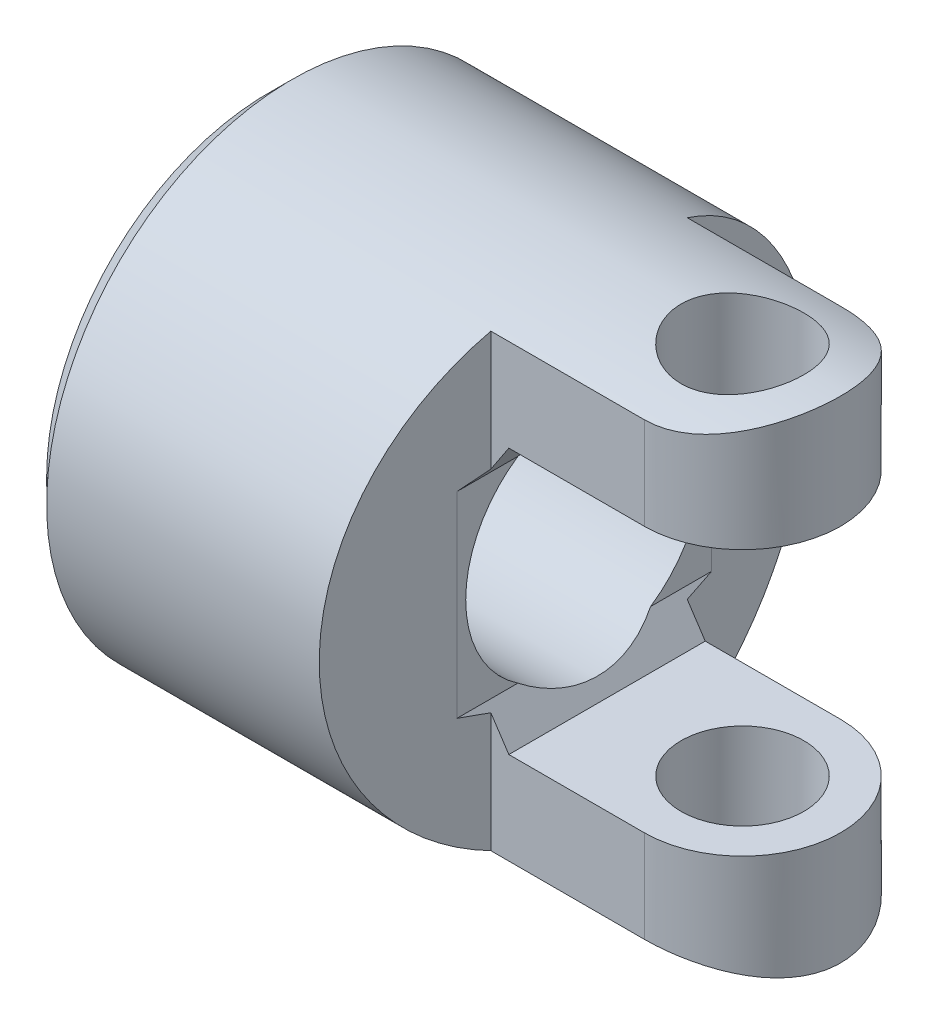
ISO-10303-21;
HEADER;
FILE_DESCRIPTION(('STEP AP214'),'2;1');
FILE_NAME('part.step','',(''),(''),'','','');
FILE_SCHEMA(('AUTOMOTIVE_DESIGN { 1 0 10303 214 1 1 1 1 }'));
ENDSEC;
DATA;
#1=APPLICATION_CONTEXT('core data for automotive mechanical design processes');
#2=APPLICATION_PROTOCOL_DEFINITION('international standard','automotive_design',2000,#1);
#3=PRODUCT_CONTEXT('',#1,'mechanical');
#4=PRODUCT('Part','Part','',(#3));
#5=PRODUCT_RELATED_PRODUCT_CATEGORY('part','',(#4));
#6=PRODUCT_DEFINITION_FORMATION('','',#4);
#7=PRODUCT_DEFINITION_CONTEXT('part definition',#1,'design');
#8=PRODUCT_DEFINITION('design','',#6,#7);
#9=PRODUCT_DEFINITION_SHAPE('','',#8);
#10=(LENGTH_UNIT() NAMED_UNIT(*) SI_UNIT(.MILLI.,.METRE.));
#11=(NAMED_UNIT(*) PLANE_ANGLE_UNIT() SI_UNIT($,.RADIAN.));
#12=(NAMED_UNIT(*) SI_UNIT($,.STERADIAN.) SOLID_ANGLE_UNIT());
#13=UNCERTAINTY_MEASURE_WITH_UNIT(LENGTH_MEASURE(1.E-05),#10,'distance_accuracy_value','');
#14=(GEOMETRIC_REPRESENTATION_CONTEXT(3) GLOBAL_UNCERTAINTY_ASSIGNED_CONTEXT((#13)) GLOBAL_UNIT_ASSIGNED_CONTEXT((#10,
#11,#12)) REPRESENTATION_CONTEXT('',''));
#15=CARTESIAN_POINT('',(0.,0.,0.));
#16=DIRECTION('',(0.,0.,1.));
#17=DIRECTION('',(1.,0.,0.));
#18=AXIS2_PLACEMENT_3D('',#15,#16,#17);
#19=CARTESIAN_POINT('',(0.,0.,0.));
#20=DIRECTION('',(1.,0.,0.));
#21=DIRECTION('',(0.,0.,-1.));
#22=AXIS2_PLACEMENT_3D('',#19,#20,#21);
#23=CONICAL_SURFACE('',#22,13.1,0.785398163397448);
#24=CARTESIAN_POINT('',(1.4,0.,0.));
#25=DIRECTION('',(1.,0.,0.));
#26=DIRECTION('',(0.,0.,-1.));
#27=AXIS2_PLACEMENT_3D('',#24,#25,#26);
#28=CIRCLE('',#27,14.5);
#29=CARTESIAN_POINT('',(1.4,0.,-14.5));
#30=VERTEX_POINT('',#29);
#31=EDGE_CURVE('E586',#30,#30,#28,.F.);
#32=ORIENTED_EDGE('',*,*,#31,.T.);
#33=EDGE_LOOP('',(#32));
#34=FACE_BOUND('',#33,.T.);
#35=CARTESIAN_POINT('',(0.,0.,0.));
#36=DIRECTION('',(1.,0.,0.));
#37=DIRECTION('',(0.,0.,-1.));
#38=AXIS2_PLACEMENT_3D('',#35,#36,#37);
#39=CIRCLE('',#38,13.1);
#40=CARTESIAN_POINT('',(0.,0.,-13.1));
#41=VERTEX_POINT('',#40);
#42=EDGE_CURVE('E583',#41,#41,#39,.F.);
#43=ORIENTED_EDGE('',*,*,#42,.F.);
#44=EDGE_LOOP('',(#43));
#45=FACE_BOUND('',#44,.T.);
#46=ADVANCED_FACE('F381',(#34,#45),#23,.T.);
#47=CARTESIAN_POINT('',(0.,-13.2572,-13.2572));
#48=DIRECTION('',(-1.,0.,0.));
#49=DIRECTION('',(0.,0.,1.));
#50=AXIS2_PLACEMENT_3D('',#47,#48,#49);
#51=PLANE('',#50);
#52=CARTESIAN_POINT('',(0.,0.,0.));
#53=DIRECTION('',(1.,0.,0.));
#54=DIRECTION('',(0.,0.,-1.));
#55=AXIS2_PLACEMENT_3D('',#52,#53,#54);
#56=CIRCLE('',#55,7.);
#57=CARTESIAN_POINT('',(0.,0.,-7.));
#58=VERTEX_POINT('',#57);
#59=EDGE_CURVE('E495',#58,#58,#56,.F.);
#60=ORIENTED_EDGE('',*,*,#59,.F.);
#61=EDGE_LOOP('',(#60));
#62=FACE_BOUND('',#61,.T.);
#63=ORIENTED_EDGE('',*,*,#42,.T.);
#64=EDGE_LOOP('',(#63));
#65=FACE_BOUND('',#64,.T.);
#66=ADVANCED_FACE('F724',(#62,#65),#51,.T.);
#67=CARTESIAN_POINT('',(0.,0.,0.));
#68=DIRECTION('',(1.,0.,0.));
#69=DIRECTION('',(0.,0.,-1.));
#70=AXIS2_PLACEMENT_3D('',#67,#68,#69);
#71=CYLINDRICAL_SURFACE('',#70,7.);
#72=CARTESIAN_POINT('',(14.8181818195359,0.,0.));
#73=DIRECTION('',(0.834176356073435,-0.551497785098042,0.));
#74=DIRECTION('',(0.551497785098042,0.834176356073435,0.));
#75=AXIS2_PLACEMENT_3D('',#72,#73,#74);
#76=ELLIPSE('',#75,8.3915109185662,7.);
#77=CARTESIAN_POINT('',(18.6527272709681,5.79999999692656,3.91918359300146));
#78=VERTEX_POINT('',#77);
#79=CARTESIAN_POINT('',(18.6527272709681,5.79999999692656,-3.91918359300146));
#80=VERTEX_POINT('',#79);
#81=EDGE_CURVE('E503',#78,#80,#76,.F.);
#82=ORIENTED_EDGE('',*,*,#81,.F.);
#83=CARTESIAN_POINT('',(18.6527272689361,0.,0.));
#84=DIRECTION('',(1.,0.,0.));
#85=DIRECTION('',(0.,0.,-1.));
#86=AXIS2_PLACEMENT_3D('',#83,#84,#85);
#87=CIRCLE('',#86,7.);
#88=CARTESIAN_POINT('',(18.6527272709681,-5.79999999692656,3.91918359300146));
#89=VERTEX_POINT('',#88);
#90=EDGE_CURVE('E485',#78,#89,#87,.T.);
#91=ORIENTED_EDGE('',*,*,#90,.T.);
#92=CARTESIAN_POINT('',(14.8181818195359,0.,0.));
#93=DIRECTION('',(-0.834176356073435,-0.551497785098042,0.));
#94=DIRECTION('',(0.551497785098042,-0.834176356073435,0.));
#95=AXIS2_PLACEMENT_3D('',#92,#93,#94);
#96=ELLIPSE('',#95,8.3915109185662,7.);
#97=CARTESIAN_POINT('',(18.6527272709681,-5.79999999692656,-3.91918359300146));
#98=VERTEX_POINT('',#97);
#99=EDGE_CURVE('E494',#89,#98,#96,.F.);
#100=ORIENTED_EDGE('',*,*,#99,.T.);
#101=CARTESIAN_POINT('',(18.6527272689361,0.,0.));
#102=DIRECTION('',(1.,0.,0.));
#103=DIRECTION('',(0.,0.,-1.));
#104=AXIS2_PLACEMENT_3D('',#101,#102,#103);
#105=CIRCLE('',#104,7.);
#106=EDGE_CURVE('E511',#98,#80,#105,.T.);
#107=ORIENTED_EDGE('',*,*,#106,.T.);
#108=EDGE_LOOP('',(#82,#91,#100,#107));
#109=FACE_BOUND('',#108,.T.);
#110=ORIENTED_EDGE('',*,*,#59,.T.);
#111=EDGE_LOOP('',(#110));
#112=FACE_BOUND('',#111,.T.);
#113=ADVANCED_FACE('F508',(#109,#112),#71,.F.);
#114=CARTESIAN_POINT('',(18.652727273,-5.8,3.897557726));
#115=DIRECTION('',(-1.,0.,0.));
#116=DIRECTION('',(0.,0.,1.));
#117=AXIS2_PLACEMENT_3D('',#114,#115,#116);
#118=PLANE('',#117);
#119=ORIENTED_EDGE('',*,*,#90,.F.);
#120=DIRECTION('',(0.,0.,1.));
#121=VECTOR('',#120,1.);
#122=CARTESIAN_POINT('',(18.652727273,5.8,5.7105258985));
#123=LINE('',#122,#121);
#124=CARTESIAN_POINT('',(18.6527272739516,5.79999999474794,7.52349405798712));
#125=VERTEX_POINT('',#124);
#126=EDGE_CURVE('E488',#78,#125,#123,.T.);
#127=ORIENTED_EDGE('',*,*,#126,.T.);
#128=DIRECTION('',(0.,1.,0.));
#129=VECTOR('',#128,1.);
#130=CARTESIAN_POINT('',(18.652727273,0.,7.523494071));
#131=LINE('',#130,#129);
#132=CARTESIAN_POINT('',(18.6527272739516,-5.79999999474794,7.52349405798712));
#133=VERTEX_POINT('',#132);
#134=EDGE_CURVE('E593',#133,#125,#131,.T.);
#135=ORIENTED_EDGE('',*,*,#134,.F.);
#136=DIRECTION('',(0.,0.,1.));
#137=VECTOR('',#136,1.);
#138=CARTESIAN_POINT('',(18.652727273,-5.8,5.7105258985));
#139=LINE('',#138,#137);
#140=EDGE_CURVE('E490',#89,#133,#139,.T.);
#141=ORIENTED_EDGE('',*,*,#140,.F.);
#142=EDGE_LOOP('',(#119,#127,#135,#141));
#143=FACE_BOUND('',#142,.T.);
#144=ADVANCED_FACE('F487',(#143),#118,.F.);
#145=CARTESIAN_POINT('',(18.9375,-13.44894315,5.8));
#146=DIRECTION('',(-0.98662283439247,0.,-0.163019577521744));
#147=DIRECTION('',(-0.163019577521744,0.,0.98662283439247));
#148=AXIS2_PLACEMENT_3D('',#145,#146,#147);
#149=PLANE('',#148);
#150=ORIENTED_EDGE('',*,*,#134,.T.);
#151=DIRECTION('',(0.158278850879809,0.239407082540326,-0.957931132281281));
#152=VECTOR('',#151,1.);
#153=CARTESIAN_POINT('',(18.6527272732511,5.79999999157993,7.5234940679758));
#154=LINE('',#153,#152);
#155=CARTESIAN_POINT('',(18.9374999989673,6.23073731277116,5.80000000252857));
#156=VERTEX_POINT('',#155);
#157=EDGE_CURVE('E505',#125,#156,#154,.T.);
#158=ORIENTED_EDGE('',*,*,#157,.T.);
#159=DIRECTION('',(0.,1.,0.));
#160=VECTOR('',#159,1.);
#161=CARTESIAN_POINT('',(18.9375,0.,5.8));
#162=LINE('',#161,#160);
#163=CARTESIAN_POINT('',(18.9374999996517,13.2894695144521,5.80000000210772));
#164=VERTEX_POINT('',#163);
#165=EDGE_CURVE('E506',#156,#164,#162,.T.);
#166=ORIENTED_EDGE('',*,*,#165,.T.);
#167=CARTESIAN_POINT('',(19.8958333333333,0.,0.));
#168=DIRECTION('',(-0.98662283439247,0.,-0.163019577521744));
#169=DIRECTION('',(0.163019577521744,0.,-0.986622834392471));
#170=AXIS2_PLACEMENT_3D('',#167,#168,#169);
#171=ELLIPSE('',#170,14.6965988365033,14.5);
#172=CARTESIAN_POINT('',(18.9374999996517,-13.2894695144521,5.80000000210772));
#173=VERTEX_POINT('',#172);
#174=EDGE_CURVE('E596',#173,#164,#171,.T.);
#175=ORIENTED_EDGE('',*,*,#174,.F.);
#176=DIRECTION('',(0.,-1.,0.));
#177=VECTOR('',#176,1.);
#178=CARTESIAN_POINT('',(18.9375,0.,5.8));
#179=LINE('',#178,#177);
#180=CARTESIAN_POINT('',(18.9374999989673,-6.23073731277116,5.80000000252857));
#181=VERTEX_POINT('',#180);
#182=EDGE_CURVE('E598',#181,#173,#179,.T.);
#183=ORIENTED_EDGE('',*,*,#182,.F.);
#184=DIRECTION('',(0.158278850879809,-0.239407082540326,-0.957931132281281));
#185=VECTOR('',#184,1.);
#186=CARTESIAN_POINT('',(18.6527272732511,-5.79999999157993,7.5234940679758));
#187=LINE('',#186,#185);
#188=EDGE_CURVE('E601',#133,#181,#187,.T.);
#189=ORIENTED_EDGE('',*,*,#188,.F.);
#190=EDGE_LOOP('',(#150,#158,#166,#175,#183,#189));
#191=FACE_BOUND('',#190,.T.);
#192=ADVANCED_FACE('F650',(#191),#149,.F.);
#193=CARTESIAN_POINT('',(1.4,0.,0.));
#194=DIRECTION('',(1.,0.,0.));
#195=DIRECTION('',(0.,0.,-1.));
#196=AXIS2_PLACEMENT_3D('',#193,#194,#195);
#197=CYLINDRICAL_SURFACE('',#196,14.5);
#198=ORIENTED_EDGE('',*,*,#174,.T.);
#199=DIRECTION('',(-1.,0.,0.));
#200=VECTOR('',#199,1.);
#201=CARTESIAN_POINT('',(17.6972,13.2894695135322,5.80000000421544));
#202=LINE('',#201,#200);
#203=CARTESIAN_POINT('',(28.0000000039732,13.2894695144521,5.80000000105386));
#204=VERTEX_POINT('',#203);
#205=EDGE_CURVE('E529',#164,#204,#202,.F.);
#206=ORIENTED_EDGE('',*,*,#205,.T.);
#207=CARTESIAN_POINT('',(28.0000000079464,13.289469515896,5.80000000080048));
#208=CARTESIAN_POINT('',(28.1560344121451,13.2894366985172,5.80002456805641));
#209=CARTESIAN_POINT('',(28.3120551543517,13.2922164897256,5.7937045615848));
#210=CARTESIAN_POINT('',(28.6228380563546,13.3031595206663,5.76856056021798));
#211=CARTESIAN_POINT('',(28.7776006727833,13.3113207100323,5.74974132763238));
#212=CARTESIAN_POINT('',(29.0841532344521,13.3327429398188,5.69988192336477));
#213=CARTESIAN_POINT('',(29.2359524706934,13.3459838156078,5.66889006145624));
#214=CARTESIAN_POINT('',(29.5361411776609,13.3771242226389,5.59501231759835));
#215=CARTESIAN_POINT('',(29.684530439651,13.3950240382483,5.55212570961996));
#216=CARTESIAN_POINT('',(29.9767318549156,13.4349003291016,5.45492468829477));
#217=CARTESIAN_POINT('',(30.1205498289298,13.4568713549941,5.40062553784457));
#218=CARTESIAN_POINT('',(30.4029741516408,13.5042537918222,5.28102839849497));
#219=CARTESIAN_POINT('',(30.5415785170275,13.529666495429,5.21572627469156));
#220=CARTESIAN_POINT('',(30.9484937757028,13.6100340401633,5.00398023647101));
#221=CARTESIAN_POINT('',(31.2079264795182,13.6691211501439,4.8416900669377));
#222=CARTESIAN_POINT('',(31.7099494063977,13.7953438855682,4.46976732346));
#223=CARTESIAN_POINT('',(31.9509919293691,13.8627369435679,4.25813252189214));
#224=CARTESIAN_POINT('',(32.2840530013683,13.9625170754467,3.91312265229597));
#225=CARTESIAN_POINT('',(32.3903785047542,13.9955784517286,3.79344578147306));
#226=CARTESIAN_POINT('',(32.5929168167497,14.0604297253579,3.54551907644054));
#227=CARTESIAN_POINT('',(32.6891331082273,14.0922200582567,3.41727221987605));
#228=CARTESIAN_POINT('',(32.8744588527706,14.1549440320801,3.14761548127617));
#229=CARTESIAN_POINT('',(32.9631296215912,14.1857924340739,3.0058841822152));
#230=CARTESIAN_POINT('',(33.1281112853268,14.2443525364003,2.71485501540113));
#231=CARTESIAN_POINT('',(33.2044272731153,14.2720655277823,2.56556029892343));
#232=CARTESIAN_POINT('',(33.3440663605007,14.3235760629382,2.26033672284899));
#233=CARTESIAN_POINT('',(33.4073880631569,14.347373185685,2.10440715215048));
#234=CARTESIAN_POINT('',(33.5203710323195,14.390335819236,1.78713253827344));
#235=CARTESIAN_POINT('',(33.5700389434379,14.4095035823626,1.62579017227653));
#236=CARTESIAN_POINT('',(33.6531664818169,14.4418453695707,1.30673869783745));
#237=CARTESIAN_POINT('',(33.6872898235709,14.4552629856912,1.14922708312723));
#238=CARTESIAN_POINT('',(33.7423296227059,14.4770062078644,0.831631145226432));
#239=CARTESIAN_POINT('',(33.7632518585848,14.4853340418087,0.671547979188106));
#240=CARTESIAN_POINT('',(33.7916776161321,14.4966671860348,0.35002181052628));
#241=CARTESIAN_POINT('',(33.7991824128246,14.4996730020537,0.188578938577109));
#242=CARTESIAN_POINT('',(33.8006909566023,14.5002763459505,-0.134377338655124));
#243=CARTESIAN_POINT('',(33.7946951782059,14.4978740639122,-0.29589074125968));
#244=CARTESIAN_POINT('',(33.7699918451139,14.4880187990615,-0.60859613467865));
#245=CARTESIAN_POINT('',(33.752020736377,14.4808584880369,-0.759856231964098));
#246=CARTESIAN_POINT('',(33.7042941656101,14.4619670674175,-1.06026707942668));
#247=CARTESIAN_POINT('',(33.6745347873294,14.4502344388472,-1.20941711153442));
#248=CARTESIAN_POINT('',(33.6035279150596,14.4224983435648,-1.50449181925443));
#249=CARTESIAN_POINT('',(33.5622843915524,14.4064963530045,-1.65041759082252));
#250=CARTESIAN_POINT('',(33.4686593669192,14.3706077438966,-1.93821443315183));
#251=CARTESIAN_POINT('',(33.4162736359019,14.3507196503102,-2.0800839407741));
#252=CARTESIAN_POINT('',(33.2999554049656,14.3072210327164,-2.36091142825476));
#253=CARTESIAN_POINT('',(33.2358648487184,14.2835601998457,-2.49979620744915));
#254=CARTESIAN_POINT('',(33.0971657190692,14.2333035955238,-2.77168169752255));
#255=CARTESIAN_POINT('',(33.0225532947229,14.2067067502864,-2.90468023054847));
#256=CARTESIAN_POINT('',(32.7837335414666,14.1234469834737,-3.2936885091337));
#257=CARTESIAN_POINT('',(32.6044679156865,14.0632854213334,-3.5398928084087));
#258=CARTESIAN_POINT('',(32.1972719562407,13.9351161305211,-4.0158844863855));
#259=CARTESIAN_POINT('',(31.9669211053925,13.8668525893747,-4.24353626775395));
#260=CARTESIAN_POINT('',(31.5952646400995,13.7666866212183,-4.55414569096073));
#261=CARTESIAN_POINT('',(31.4669185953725,13.7336457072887,-4.65259935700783));
#262=CARTESIAN_POINT('',(31.20218755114,13.6692186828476,-4.83860832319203));
#263=CARTESIAN_POINT('',(31.0658055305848,13.6378319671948,-4.926167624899));
#264=CARTESIAN_POINT('',(30.7816623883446,13.5767388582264,-5.09217265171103));
#265=CARTESIAN_POINT('',(30.6336849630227,13.5471086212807,-5.17027627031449));
#266=CARTESIAN_POINT('',(30.3310220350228,13.4915362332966,-5.31360108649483));
#267=CARTESIAN_POINT('',(30.1763394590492,13.4655924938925,-5.3788278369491));
#268=CARTESIAN_POINT('',(29.8614704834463,13.4183043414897,-5.49573380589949));
#269=CARTESIAN_POINT('',(29.7012912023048,13.3969542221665,-5.54742985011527));
#270=CARTESIAN_POINT('',(29.376530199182,13.359596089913,-5.6368008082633));
#271=CARTESIAN_POINT('',(29.2119504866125,13.3435856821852,-5.67448200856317));
#272=CARTESIAN_POINT('',(28.8737042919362,13.3170581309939,-5.73648105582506));
#273=CARTESIAN_POINT('',(28.6999235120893,13.3067583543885,-5.76027174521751));
#274=CARTESIAN_POINT('',(28.3507680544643,13.2929400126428,-5.79204607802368));
#275=CARTESIAN_POINT('',(28.1753944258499,13.289417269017,-5.80003946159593));
#276=CARTESIAN_POINT('',(28.0000000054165,13.2894695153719,-5.8));
#277=B_SPLINE_CURVE_WITH_KNOTS('',3,(#207,#208,#209,#210,#211,#212,#213,#214,#215,#216,#217,
#218,#219,#220,#221,#222,#223,#224,#225,#226,#227,#228,#229,#230,#231,#232,#233,#234,#235,#236,
#237,#238,#239,#240,#241,#242,#243,#244,#245,#246,#247,#248,#249,#250,#251,#252,#253,#254,#255,
#256,#257,#258,#259,#260,#261,#262,#263,#264,#265,#266,#267,#268,#269,#270,#271,#272,#273,#274,
#275,#276),.UNSPECIFIED.,.F.,.F.,(4,2,2,2,2,2,2,2,2,2,2,2,2,2,2,2,2,2,2,2,2,2,2,2,2,2,2,2,2,2,2,
2,2,2,4),(0.,0.467929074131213,0.935679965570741,1.40159294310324,1.86753436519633,
2.33285656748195,2.7983540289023,3.72928693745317,4.70799671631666,5.19794388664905,
5.68772170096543,6.19710599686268,6.70627977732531,7.21550826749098,7.72448850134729,
8.20903093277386,8.69336111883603,9.1776452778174,9.66191241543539,10.1188513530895,
10.5759422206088,11.0328752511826,11.4899820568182,11.9537918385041,12.4177718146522,
13.345140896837,14.3333290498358,14.8281619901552,15.3228126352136,15.8319534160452,
16.3408741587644,16.8491590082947,17.3572155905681,17.8834750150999,18.4094098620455),.UNSPECIFIED.);
#278=CARTESIAN_POINT('',(28.,13.2894695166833,-5.79999999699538));
#279=VERTEX_POINT('',#278);
#280=EDGE_CURVE('E521',#204,#279,#277,.T.);
#281=ORIENTED_EDGE('',*,*,#280,.T.);
#282=DIRECTION('',(1.,0.,0.));
#283=VECTOR('',#282,1.);
#284=CARTESIAN_POINT('',(17.6972,13.2894695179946,-5.79999999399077));
#285=LINE('',#284,#283);
#286=CARTESIAN_POINT('',(18.9375000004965,13.2894695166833,-5.79999999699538));
#287=VERTEX_POINT('',#286);
#288=EDGE_CURVE('E518',#279,#287,#285,.F.);
#289=ORIENTED_EDGE('',*,*,#288,.T.);
#290=CARTESIAN_POINT('',(19.8958333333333,0.,0.));
#291=DIRECTION('',(-0.98662283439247,0.,0.163019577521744));
#292=DIRECTION('',(0.163019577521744,0.,0.986622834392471));
#293=AXIS2_PLACEMENT_3D('',#290,#291,#292);
#294=ELLIPSE('',#293,14.6965988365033,14.5);
#295=CARTESIAN_POINT('',(18.9375000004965,-13.2894695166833,-5.79999999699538));
#296=VERTEX_POINT('',#295);
#297=EDGE_CURVE('E604',#287,#296,#294,.T.);
#298=ORIENTED_EDGE('',*,*,#297,.T.);
#299=DIRECTION('',(1.,0.,0.));
#300=VECTOR('',#299,1.);
#301=CARTESIAN_POINT('',(17.6972,-13.2894695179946,-5.79999999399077));
#302=LINE('',#301,#300);
#303=CARTESIAN_POINT('',(28.,-13.2894695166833,-5.79999999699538));
#304=VERTEX_POINT('',#303);
#305=EDGE_CURVE('E606',#304,#296,#302,.F.);
#306=ORIENTED_EDGE('',*,*,#305,.F.);
#307=CARTESIAN_POINT('',(28.0000000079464,-13.289469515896,5.80000000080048));
#308=CARTESIAN_POINT('',(28.1560344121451,-13.2894366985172,5.80002456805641));
#309=CARTESIAN_POINT('',(28.3120551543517,-13.2922164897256,5.7937045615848));
#310=CARTESIAN_POINT('',(28.6228380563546,-13.3031595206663,5.76856056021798));
#311=CARTESIAN_POINT('',(28.7776006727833,-13.3113207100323,5.74974132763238));
#312=CARTESIAN_POINT('',(29.0841532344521,-13.3327429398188,5.69988192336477));
#313=CARTESIAN_POINT('',(29.2359524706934,-13.3459838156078,5.66889006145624));
#314=CARTESIAN_POINT('',(29.5361411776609,-13.3771242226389,5.59501231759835));
#315=CARTESIAN_POINT('',(29.684530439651,-13.3950240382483,5.55212570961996));
#316=CARTESIAN_POINT('',(29.9767318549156,-13.4349003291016,5.45492468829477));
#317=CARTESIAN_POINT('',(30.1205498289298,-13.4568713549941,5.40062553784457));
#318=CARTESIAN_POINT('',(30.4029741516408,-13.5042537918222,5.28102839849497));
#319=CARTESIAN_POINT('',(30.5415785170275,-13.529666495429,5.21572627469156));
#320=CARTESIAN_POINT('',(30.9484937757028,-13.6100340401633,5.00398023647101));
#321=CARTESIAN_POINT('',(31.2079264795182,-13.6691211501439,4.8416900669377));
#322=CARTESIAN_POINT('',(31.7099494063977,-13.7953438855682,4.46976732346));
#323=CARTESIAN_POINT('',(31.9509919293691,-13.8627369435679,4.25813252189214));
#324=CARTESIAN_POINT('',(32.2840530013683,-13.9625170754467,3.91312265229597));
#325=CARTESIAN_POINT('',(32.3903785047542,-13.9955784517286,3.79344578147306));
#326=CARTESIAN_POINT('',(32.5929168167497,-14.0604297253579,3.54551907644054));
#327=CARTESIAN_POINT('',(32.6891331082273,-14.0922200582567,3.41727221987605));
#328=CARTESIAN_POINT('',(32.8744588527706,-14.1549440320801,3.14761548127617));
#329=CARTESIAN_POINT('',(32.9631296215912,-14.1857924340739,3.0058841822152));
#330=CARTESIAN_POINT('',(33.1281112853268,-14.2443525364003,2.71485501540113));
#331=CARTESIAN_POINT('',(33.2044272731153,-14.2720655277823,2.56556029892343));
#332=CARTESIAN_POINT('',(33.3440663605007,-14.3235760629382,2.26033672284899));
#333=CARTESIAN_POINT('',(33.4073880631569,-14.347373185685,2.10440715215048));
#334=CARTESIAN_POINT('',(33.5203710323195,-14.390335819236,1.78713253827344));
#335=CARTESIAN_POINT('',(33.5700389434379,-14.4095035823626,1.62579017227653));
#336=CARTESIAN_POINT('',(33.6531664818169,-14.4418453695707,1.30673869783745));
#337=CARTESIAN_POINT('',(33.6872898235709,-14.4552629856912,1.14922708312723));
#338=CARTESIAN_POINT('',(33.7423296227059,-14.4770062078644,0.831631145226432));
#339=CARTESIAN_POINT('',(33.7632518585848,-14.4853340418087,0.671547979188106));
#340=CARTESIAN_POINT('',(33.7916776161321,-14.4966671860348,0.35002181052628));
#341=CARTESIAN_POINT('',(33.7991824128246,-14.4996730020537,0.188578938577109));
#342=CARTESIAN_POINT('',(33.8006909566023,-14.5002763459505,-0.134377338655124));
#343=CARTESIAN_POINT('',(33.7946951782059,-14.4978740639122,-0.29589074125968));
#344=CARTESIAN_POINT('',(33.7699918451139,-14.4880187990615,-0.60859613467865));
#345=CARTESIAN_POINT('',(33.752020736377,-14.4808584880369,-0.759856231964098));
#346=CARTESIAN_POINT('',(33.7042941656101,-14.4619670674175,-1.06026707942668));
#347=CARTESIAN_POINT('',(33.6745347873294,-14.4502344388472,-1.20941711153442));
#348=CARTESIAN_POINT('',(33.6035279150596,-14.4224983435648,-1.50449181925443));
#349=CARTESIAN_POINT('',(33.5622843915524,-14.4064963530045,-1.65041759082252));
#350=CARTESIAN_POINT('',(33.4686593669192,-14.3706077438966,-1.93821443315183));
#351=CARTESIAN_POINT('',(33.4162736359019,-14.3507196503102,-2.0800839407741));
#352=CARTESIAN_POINT('',(33.2999554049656,-14.3072210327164,-2.36091142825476));
#353=CARTESIAN_POINT('',(33.2358648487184,-14.2835601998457,-2.49979620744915));
#354=CARTESIAN_POINT('',(33.0971657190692,-14.2333035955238,-2.77168169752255));
#355=CARTESIAN_POINT('',(33.0225532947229,-14.2067067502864,-2.90468023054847));
#356=CARTESIAN_POINT('',(32.7837335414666,-14.1234469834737,-3.2936885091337));
#357=CARTESIAN_POINT('',(32.6044679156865,-14.0632854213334,-3.5398928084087));
#358=CARTESIAN_POINT('',(32.1972719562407,-13.9351161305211,-4.0158844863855));
#359=CARTESIAN_POINT('',(31.9669211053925,-13.8668525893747,-4.24353626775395));
#360=CARTESIAN_POINT('',(31.5952646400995,-13.7666866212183,-4.55414569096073));
#361=CARTESIAN_POINT('',(31.4669185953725,-13.7336457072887,-4.65259935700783));
#362=CARTESIAN_POINT('',(31.20218755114,-13.6692186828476,-4.83860832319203));
#363=CARTESIAN_POINT('',(31.0658055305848,-13.6378319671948,-4.926167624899));
#364=CARTESIAN_POINT('',(30.7816623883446,-13.5767388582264,-5.09217265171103));
#365=CARTESIAN_POINT('',(30.6336849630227,-13.5471086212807,-5.17027627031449));
#366=CARTESIAN_POINT('',(30.3310220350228,-13.4915362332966,-5.31360108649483));
#367=CARTESIAN_POINT('',(30.1763394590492,-13.4655924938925,-5.3788278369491));
#368=CARTESIAN_POINT('',(29.8614704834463,-13.4183043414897,-5.49573380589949));
#369=CARTESIAN_POINT('',(29.7012912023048,-13.3969542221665,-5.54742985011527));
#370=CARTESIAN_POINT('',(29.376530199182,-13.359596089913,-5.6368008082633));
#371=CARTESIAN_POINT('',(29.2119504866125,-13.3435856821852,-5.67448200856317));
#372=CARTESIAN_POINT('',(28.8737042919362,-13.3170581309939,-5.73648105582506));
#373=CARTESIAN_POINT('',(28.6999235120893,-13.3067583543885,-5.76027174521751));
#374=CARTESIAN_POINT('',(28.3507680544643,-13.2929400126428,-5.79204607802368));
#375=CARTESIAN_POINT('',(28.1753944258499,-13.289417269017,-5.80003946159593));
#376=CARTESIAN_POINT('',(28.0000000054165,-13.2894695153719,-5.8));
#377=B_SPLINE_CURVE_WITH_KNOTS('',3,(#307,#308,#309,#310,#311,#312,#313,#314,#315,#316,#317,
#318,#319,#320,#321,#322,#323,#324,#325,#326,#327,#328,#329,#330,#331,#332,#333,#334,#335,#336,
#337,#338,#339,#340,#341,#342,#343,#344,#345,#346,#347,#348,#349,#350,#351,#352,#353,#354,#355,
#356,#357,#358,#359,#360,#361,#362,#363,#364,#365,#366,#367,#368,#369,#370,#371,#372,#373,#374,
#375,#376),.UNSPECIFIED.,.F.,.F.,(4,2,2,2,2,2,2,2,2,2,2,2,2,2,2,2,2,2,2,2,2,2,2,2,2,2,2,2,2,2,2,
2,2,2,4),(0.,0.467929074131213,0.935679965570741,1.40159294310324,1.86753436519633,
2.33285656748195,2.7983540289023,3.72928693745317,4.70799671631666,5.19794388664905,
5.68772170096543,6.19710599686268,6.70627977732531,7.21550826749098,7.72448850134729,
8.20903093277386,8.69336111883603,9.1776452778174,9.66191241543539,10.1188513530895,
10.5759422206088,11.0328752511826,11.4899820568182,11.9537918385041,12.4177718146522,
13.345140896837,14.3333290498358,14.8281619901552,15.3228126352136,15.8319534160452,
16.3408741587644,16.8491590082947,17.3572155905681,17.8834750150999,18.4094098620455),.UNSPECIFIED.);
#378=CARTESIAN_POINT('',(28.0000000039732,-13.2894695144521,5.80000000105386));
#379=VERTEX_POINT('',#378);
#380=EDGE_CURVE('E609',#379,#304,#377,.T.);
#381=ORIENTED_EDGE('',*,*,#380,.F.);
#382=DIRECTION('',(-1.,0.,0.));
#383=VECTOR('',#382,1.);
#384=CARTESIAN_POINT('',(17.6972,-13.2894695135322,5.80000000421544));
#385=LINE('',#384,#383);
#386=EDGE_CURVE('E615',#173,#379,#385,.F.);
#387=ORIENTED_EDGE('',*,*,#386,.F.);
#388=EDGE_LOOP('',(#198,#206,#281,#289,#298,#306,#381,#387));
#389=FACE_BOUND('',#388,.T.);
#390=ORIENTED_EDGE('',*,*,#31,.F.);
#391=EDGE_LOOP('',(#390));
#392=FACE_BOUND('',#391,.T.);
#393=CARTESIAN_POINT('',(28.0000000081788,-14.0395646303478,3.62500000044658));
#394=CARTESIAN_POINT('',(27.8999855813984,-14.0395651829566,3.62499893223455));
#395=CARTESIAN_POINT('',(27.7999585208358,-14.0406374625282,3.62085462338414));
#396=CARTESIAN_POINT('',(27.600620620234,-14.0448891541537,3.60432320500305));
#397=CARTESIAN_POINT('',(27.5013101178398,-14.0480695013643,3.59193243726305));
#398=CARTESIAN_POINT('',(27.2052558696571,-14.0606645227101,3.54245400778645));
#399=CARTESIAN_POINT('',(27.0105437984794,-14.0731329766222,3.49306037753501));
#400=CARTESIAN_POINT('',(26.6328716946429,-14.1047127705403,3.363251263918));
#401=CARTESIAN_POINT('',(26.4498911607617,-14.1238121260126,3.28289171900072));
#402=CARTESIAN_POINT('',(26.1000100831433,-14.1664809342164,3.0935742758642));
#403=CARTESIAN_POINT('',(25.9331055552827,-14.1900492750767,2.98462348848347));
#404=CARTESIAN_POINT('',(25.6164023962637,-14.2395896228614,2.73863052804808));
#405=CARTESIAN_POINT('',(25.4670117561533,-14.2656002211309,2.60107099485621));
#406=CARTESIAN_POINT('',(25.1931534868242,-14.3167603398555,2.30287280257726));
#407=CARTESIAN_POINT('',(25.0686895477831,-14.3419097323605,2.14223073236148));
#408=CARTESIAN_POINT('',(24.8465749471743,-14.3889361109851,1.7996598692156));
#409=CARTESIAN_POINT('',(24.7493219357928,-14.4107626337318,1.61746572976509));
#410=CARTESIAN_POINT('',(24.5869755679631,-14.4482468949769,1.23868010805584));
#411=CARTESIAN_POINT('',(24.5218772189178,-14.4639055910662,1.04209086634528));
#412=CARTESIAN_POINT('',(24.4269856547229,-14.4870189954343,0.644320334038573));
#413=CARTESIAN_POINT('',(24.3965040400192,-14.4946334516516,0.44331270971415));
#414=CARTESIAN_POINT('',(24.3695503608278,-14.5013571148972,0.0389020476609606));
#415=CARTESIAN_POINT('',(24.3730733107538,-14.5004675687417,-0.164500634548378));
#416=CARTESIAN_POINT('',(24.4135334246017,-14.4904023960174,-0.56315123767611));
#417=CARTESIAN_POINT('',(24.4497272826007,-14.4814111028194,-0.758479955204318));
#418=CARTESIAN_POINT('',(24.5533080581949,-14.456367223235,-1.14019999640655));
#419=CARTESIAN_POINT('',(24.6206968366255,-14.440314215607,-1.32659078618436));
#420=CARTESIAN_POINT('',(24.7853558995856,-14.402668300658,-1.6871050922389));
#421=CARTESIAN_POINT('',(24.882891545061,-14.3810264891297,-1.8611020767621));
#422=CARTESIAN_POINT('',(25.1048762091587,-14.3345518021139,-2.19051037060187));
#423=CARTESIAN_POINT('',(25.2293281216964,-14.3097185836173,-2.34591967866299));
#424=CARTESIAN_POINT('',(25.5055414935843,-14.2587795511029,-2.63814809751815));
#425=CARTESIAN_POINT('',(25.6579474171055,-14.2326574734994,-2.77435481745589));
#426=CARTESIAN_POINT('',(25.9838821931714,-14.1826755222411,-3.01950838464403));
#427=CARTESIAN_POINT('',(26.1574203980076,-14.1588166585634,-3.12844309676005));
#428=CARTESIAN_POINT('',(26.4303111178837,-14.1267480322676,-3.26914501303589));
#429=CARTESIAN_POINT('',(26.5237048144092,-14.1166510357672,-3.31236812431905));
#430=CARTESIAN_POINT('',(26.7139514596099,-14.0980267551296,-3.39076227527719));
#431=CARTESIAN_POINT('',(26.810803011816,-14.0894988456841,-3.42593652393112));
#432=CARTESIAN_POINT('',(27.0071114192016,-14.0742899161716,-3.48789038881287));
#433=CARTESIAN_POINT('',(27.1065636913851,-14.0676058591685,-3.51468381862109));
#434=CARTESIAN_POINT('',(27.307460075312,-14.0562775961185,-3.55971929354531));
#435=CARTESIAN_POINT('',(27.4089032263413,-14.0516324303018,-3.57796536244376));
#436=CARTESIAN_POINT('',(27.5919458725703,-14.045259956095,-3.60288756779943));
#437=CARTESIAN_POINT('',(27.6733158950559,-14.0431281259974,-3.61117510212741));
#438=CARTESIAN_POINT('',(27.8364544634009,-14.0402802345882,-3.62223176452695));
#439=CARTESIAN_POINT('',(27.9182230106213,-14.039564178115,-3.62500087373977));
#440=CARTESIAN_POINT('',(28.1000144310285,-14.0395651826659,-3.62499893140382));
#441=CARTESIAN_POINT('',(28.2000414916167,-14.0406374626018,-3.62085462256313));
#442=CARTESIAN_POINT('',(28.3993793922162,-14.0448891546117,-3.60432320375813));
#443=CARTESIAN_POINT('',(28.4986898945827,-14.0480695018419,-3.59193243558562));
#444=CARTESIAN_POINT('',(28.7947441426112,-14.0606645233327,-3.54245400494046));
#445=CARTESIAN_POINT('',(28.9894562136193,-14.0731329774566,-3.49306037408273));
#446=CARTESIAN_POINT('',(29.3671283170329,-14.1047127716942,-3.3632512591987));
#447=CARTESIAN_POINT('',(29.5501088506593,-14.1238121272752,-3.28289171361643));
#448=CARTESIAN_POINT('',(29.8999899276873,-14.1664809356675,-3.09357426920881));
#449=CARTESIAN_POINT('',(30.0668944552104,-14.190049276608,-2.9846234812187));
#450=CARTESIAN_POINT('',(30.3835976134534,-14.2395896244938,-2.73863051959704));
#451=CARTESIAN_POINT('',(30.5329882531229,-14.265600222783,-2.60107098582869));
#452=CARTESIAN_POINT('',(30.8068465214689,-14.3167603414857,-2.30287279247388));
#453=CARTESIAN_POINT('',(30.931310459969,-14.3419097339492,-2.14223072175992));
#454=CARTESIAN_POINT('',(31.1534250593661,-14.3889361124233,-1.79965985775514));
#455=CARTESIAN_POINT('',(31.2506780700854,-14.4107626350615,-1.61746571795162));
#456=CARTESIAN_POINT('',(31.4130244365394,-14.4482468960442,-1.23868009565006));
#457=CARTESIAN_POINT('',(31.4781227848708,-14.4639055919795,-1.04209085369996));
#458=CARTESIAN_POINT('',(31.573014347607,-14.4870189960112,-0.644320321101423));
#459=CARTESIAN_POINT('',(31.6034959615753,-14.4946334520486,-0.443312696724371));
#460=CARTESIAN_POINT('',(31.6304496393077,-14.5013571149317,-0.0389020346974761));
#461=CARTESIAN_POINT('',(31.626926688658,-14.5004675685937,0.164500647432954));
#462=CARTESIAN_POINT('',(31.5864665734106,-14.4904023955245,0.563151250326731));
#463=CARTESIAN_POINT('',(31.5502727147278,-14.4814111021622,0.758479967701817));
#464=CARTESIAN_POINT('',(31.4466919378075,-14.4563672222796,1.14020000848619));
#465=CARTESIAN_POINT('',(31.3793031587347,-14.4403142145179,1.3265907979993));
#466=CARTESIAN_POINT('',(31.2146440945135,-14.4026682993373,1.68710510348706));
#467=CARTESIAN_POINT('',(31.1171084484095,-14.3810264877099,1.8611020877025));
#468=CARTESIAN_POINT('',(30.8951237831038,-14.3345518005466,2.19051038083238));
#469=CARTESIAN_POINT('',(30.7706718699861,-14.3097185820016,2.34591968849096));
#470=CARTESIAN_POINT('',(30.4944584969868,-14.2587795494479,2.63814810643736));
#471=CARTESIAN_POINT('',(30.3420525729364,-14.2326574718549,2.7743548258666));
#472=CARTESIAN_POINT('',(30.0161177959,-14.1826755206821,3.01950839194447));
#473=CARTESIAN_POINT('',(29.8425795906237,-14.1588166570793,3.12844310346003));
#474=CARTESIAN_POINT('',(29.5696888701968,-14.1267480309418,3.26914501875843));
#475=CARTESIAN_POINT('',(29.4762951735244,-14.1166510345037,3.31236812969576));
#476=CARTESIAN_POINT('',(29.2860485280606,-14.0980267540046,3.39076227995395));
#477=CARTESIAN_POINT('',(29.1891969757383,-14.0894988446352,3.42593652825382));
#478=CARTESIAN_POINT('',(28.9928885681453,-14.0742899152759,3.48789039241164));
#479=CARTESIAN_POINT('',(28.8934362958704,-14.0676058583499,3.51468382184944));
#480=CARTESIAN_POINT('',(28.6925399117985,-14.0562775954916,3.55971929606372));
#481=CARTESIAN_POINT('',(28.5910967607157,-14.0516324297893,3.57796536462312));
#482=CARTESIAN_POINT('',(28.4080541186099,-14.0452599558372,3.60288756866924));
#483=CARTESIAN_POINT('',(28.3266841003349,-14.0431281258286,3.61117510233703));
#484=CARTESIAN_POINT('',(28.1635455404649,-14.040280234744,3.62223176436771));
#485=CARTESIAN_POINT('',(28.081776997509,-14.0395641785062,3.6250008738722));
#486=CARTESIAN_POINT('',(28.0000000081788,-14.0395646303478,3.62500000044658));
#487=B_SPLINE_CURVE_WITH_KNOTS('',3,(#393,#394,#395,#396,#397,#398,#399,#400,#401,#402,#403,
#404,#405,#406,#407,#408,#409,#410,#411,#412,#413,#414,#415,#416,#417,#418,#419,#420,#421,#422,
#423,#424,#425,#426,#427,#428,#429,#430,#431,#432,#433,#434,#435,#436,#437,#438,#439,#440,#441,
#442,#443,#444,#445,#446,#447,#448,#449,#450,#451,#452,#453,#454,#455,#456,#457,#458,#459,#460,
#461,#462,#463,#464,#465,#466,#467,#468,#469,#470,#471,#472,#473,#474,#475,#476,#477,#478,#479,
#480,#481,#482,#483,#484,#485,#486),.UNSPECIFIED.,.T.,.F.,(4,2,2,2,2,2,2,2,2,2,2,2,2,2,2,2,2,2,
2,2,2,2,2,2,2,2,2,2,2,2,2,2,2,2,2,2,2,2,2,2,2,2,2,2,2,2,4),(0.,0.299962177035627,
0.600057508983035,1.20070544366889,1.80027338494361,2.39969235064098,3.01107729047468,
3.62255267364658,4.24254569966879,4.86244243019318,5.46978312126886,6.07703476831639,
6.6708095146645,7.2646196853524,7.86381321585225,8.46307120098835,9.07844608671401,
9.69409430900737,10.0039934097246,10.313768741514,10.6230307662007,10.9321470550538,
11.1774108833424,11.4226755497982,11.7226377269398,12.0227330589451,12.6233809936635,
13.2229489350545,13.8223679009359,14.4337528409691,15.045228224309,15.6652212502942,
16.285117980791,16.8924586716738,17.4997103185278,18.0934850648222,18.6872952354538,
19.2864887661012,19.885746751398,20.5011216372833,21.1167698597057,21.4266689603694,
21.7364442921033,22.0457063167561,22.3548226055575,22.6000864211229,22.8453510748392),.UNSPECIFIED.);
#488=CARTESIAN_POINT('',(28.0000000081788,-14.0395646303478,3.62500000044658));
#489=VERTEX_POINT('',#488);
#490=EDGE_CURVE('E672',#489,#489,#487,.T.);
#491=ORIENTED_EDGE('',*,*,#490,.F.);
#492=EDGE_LOOP('',(#491));
#493=FACE_BOUND('',#492,.T.);
#494=CARTESIAN_POINT('',(28.0000000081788,14.0395646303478,3.62500000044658));
#495=CARTESIAN_POINT('',(27.8999855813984,14.0395651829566,3.62499893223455));
#496=CARTESIAN_POINT('',(27.7999585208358,14.0406374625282,3.62085462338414));
#497=CARTESIAN_POINT('',(27.600620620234,14.0448891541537,3.60432320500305));
#498=CARTESIAN_POINT('',(27.5013101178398,14.0480695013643,3.59193243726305));
#499=CARTESIAN_POINT('',(27.2052558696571,14.0606645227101,3.54245400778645));
#500=CARTESIAN_POINT('',(27.0105437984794,14.0731329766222,3.49306037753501));
#501=CARTESIAN_POINT('',(26.6328716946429,14.1047127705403,3.363251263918));
#502=CARTESIAN_POINT('',(26.4498911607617,14.1238121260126,3.28289171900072));
#503=CARTESIAN_POINT('',(26.1000100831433,14.1664809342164,3.0935742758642));
#504=CARTESIAN_POINT('',(25.9331055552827,14.1900492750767,2.98462348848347));
#505=CARTESIAN_POINT('',(25.6164023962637,14.2395896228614,2.73863052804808));
#506=CARTESIAN_POINT('',(25.4670117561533,14.2656002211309,2.60107099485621));
#507=CARTESIAN_POINT('',(25.1931534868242,14.3167603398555,2.30287280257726));
#508=CARTESIAN_POINT('',(25.0686895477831,14.3419097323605,2.14223073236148));
#509=CARTESIAN_POINT('',(24.8465749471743,14.3889361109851,1.7996598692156));
#510=CARTESIAN_POINT('',(24.7493219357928,14.4107626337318,1.61746572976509));
#511=CARTESIAN_POINT('',(24.5869755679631,14.4482468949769,1.23868010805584));
#512=CARTESIAN_POINT('',(24.5218772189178,14.4639055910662,1.04209086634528));
#513=CARTESIAN_POINT('',(24.4269856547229,14.4870189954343,0.644320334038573));
#514=CARTESIAN_POINT('',(24.3965040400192,14.4946334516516,0.44331270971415));
#515=CARTESIAN_POINT('',(24.3695503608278,14.5013571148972,0.0389020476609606));
#516=CARTESIAN_POINT('',(24.3730733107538,14.5004675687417,-0.164500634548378));
#517=CARTESIAN_POINT('',(24.4135334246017,14.4904023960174,-0.56315123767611));
#518=CARTESIAN_POINT('',(24.4497272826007,14.4814111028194,-0.758479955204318));
#519=CARTESIAN_POINT('',(24.5533080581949,14.456367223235,-1.14019999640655));
#520=CARTESIAN_POINT('',(24.6206968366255,14.440314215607,-1.32659078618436));
#521=CARTESIAN_POINT('',(24.7853558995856,14.402668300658,-1.6871050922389));
#522=CARTESIAN_POINT('',(24.882891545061,14.3810264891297,-1.8611020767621));
#523=CARTESIAN_POINT('',(25.1048762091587,14.3345518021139,-2.19051037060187));
#524=CARTESIAN_POINT('',(25.2293281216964,14.3097185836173,-2.34591967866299));
#525=CARTESIAN_POINT('',(25.5055414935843,14.2587795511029,-2.63814809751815));
#526=CARTESIAN_POINT('',(25.6579474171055,14.2326574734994,-2.77435481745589));
#527=CARTESIAN_POINT('',(25.9838821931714,14.1826755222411,-3.01950838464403));
#528=CARTESIAN_POINT('',(26.1574203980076,14.1588166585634,-3.12844309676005));
#529=CARTESIAN_POINT('',(26.4303111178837,14.1267480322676,-3.26914501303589));
#530=CARTESIAN_POINT('',(26.5237048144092,14.1166510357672,-3.31236812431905));
#531=CARTESIAN_POINT('',(26.7139514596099,14.0980267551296,-3.39076227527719));
#532=CARTESIAN_POINT('',(26.810803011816,14.0894988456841,-3.42593652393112));
#533=CARTESIAN_POINT('',(27.0071114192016,14.0742899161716,-3.48789038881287));
#534=CARTESIAN_POINT('',(27.1065636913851,14.0676058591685,-3.51468381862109));
#535=CARTESIAN_POINT('',(27.307460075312,14.0562775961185,-3.55971929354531));
#536=CARTESIAN_POINT('',(27.4089032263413,14.0516324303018,-3.57796536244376));
#537=CARTESIAN_POINT('',(27.5919458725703,14.045259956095,-3.60288756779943));
#538=CARTESIAN_POINT('',(27.6733158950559,14.0431281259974,-3.61117510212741));
#539=CARTESIAN_POINT('',(27.8364544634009,14.0402802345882,-3.62223176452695));
#540=CARTESIAN_POINT('',(27.9182230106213,14.039564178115,-3.62500087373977));
#541=CARTESIAN_POINT('',(28.1000144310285,14.0395651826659,-3.62499893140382));
#542=CARTESIAN_POINT('',(28.2000414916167,14.0406374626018,-3.62085462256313));
#543=CARTESIAN_POINT('',(28.3993793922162,14.0448891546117,-3.60432320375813));
#544=CARTESIAN_POINT('',(28.4986898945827,14.0480695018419,-3.59193243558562));
#545=CARTESIAN_POINT('',(28.7947441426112,14.0606645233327,-3.54245400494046));
#546=CARTESIAN_POINT('',(28.9894562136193,14.0731329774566,-3.49306037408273));
#547=CARTESIAN_POINT('',(29.3671283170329,14.1047127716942,-3.3632512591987));
#548=CARTESIAN_POINT('',(29.5501088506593,14.1238121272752,-3.28289171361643));
#549=CARTESIAN_POINT('',(29.8999899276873,14.1664809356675,-3.09357426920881));
#550=CARTESIAN_POINT('',(30.0668944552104,14.190049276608,-2.9846234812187));
#551=CARTESIAN_POINT('',(30.3835976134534,14.2395896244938,-2.73863051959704));
#552=CARTESIAN_POINT('',(30.5329882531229,14.265600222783,-2.60107098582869));
#553=CARTESIAN_POINT('',(30.8068465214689,14.3167603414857,-2.30287279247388));
#554=CARTESIAN_POINT('',(30.931310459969,14.3419097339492,-2.14223072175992));
#555=CARTESIAN_POINT('',(31.1534250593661,14.3889361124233,-1.79965985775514));
#556=CARTESIAN_POINT('',(31.2506780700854,14.4107626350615,-1.61746571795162));
#557=CARTESIAN_POINT('',(31.4130244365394,14.4482468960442,-1.23868009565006));
#558=CARTESIAN_POINT('',(31.4781227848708,14.4639055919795,-1.04209085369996));
#559=CARTESIAN_POINT('',(31.573014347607,14.4870189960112,-0.644320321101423));
#560=CARTESIAN_POINT('',(31.6034959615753,14.4946334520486,-0.443312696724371));
#561=CARTESIAN_POINT('',(31.6304496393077,14.5013571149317,-0.0389020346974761));
#562=CARTESIAN_POINT('',(31.626926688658,14.5004675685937,0.164500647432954));
#563=CARTESIAN_POINT('',(31.5864665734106,14.4904023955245,0.563151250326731));
#564=CARTESIAN_POINT('',(31.5502727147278,14.4814111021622,0.758479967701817));
#565=CARTESIAN_POINT('',(31.4466919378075,14.4563672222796,1.14020000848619));
#566=CARTESIAN_POINT('',(31.3793031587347,14.4403142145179,1.3265907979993));
#567=CARTESIAN_POINT('',(31.2146440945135,14.4026682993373,1.68710510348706));
#568=CARTESIAN_POINT('',(31.1171084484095,14.3810264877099,1.8611020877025));
#569=CARTESIAN_POINT('',(30.8951237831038,14.3345518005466,2.19051038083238));
#570=CARTESIAN_POINT('',(30.7706718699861,14.3097185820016,2.34591968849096));
#571=CARTESIAN_POINT('',(30.4944584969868,14.2587795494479,2.63814810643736));
#572=CARTESIAN_POINT('',(30.3420525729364,14.2326574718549,2.7743548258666));
#573=CARTESIAN_POINT('',(30.0161177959,14.1826755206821,3.01950839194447));
#574=CARTESIAN_POINT('',(29.8425795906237,14.1588166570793,3.12844310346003));
#575=CARTESIAN_POINT('',(29.5696888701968,14.1267480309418,3.26914501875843));
#576=CARTESIAN_POINT('',(29.4762951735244,14.1166510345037,3.31236812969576));
#577=CARTESIAN_POINT('',(29.2860485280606,14.0980267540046,3.39076227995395));
#578=CARTESIAN_POINT('',(29.1891969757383,14.0894988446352,3.42593652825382));
#579=CARTESIAN_POINT('',(28.9928885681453,14.0742899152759,3.48789039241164));
#580=CARTESIAN_POINT('',(28.8934362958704,14.0676058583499,3.51468382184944));
#581=CARTESIAN_POINT('',(28.6925399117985,14.0562775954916,3.55971929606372));
#582=CARTESIAN_POINT('',(28.5910967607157,14.0516324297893,3.57796536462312));
#583=CARTESIAN_POINT('',(28.4080541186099,14.0452599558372,3.60288756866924));
#584=CARTESIAN_POINT('',(28.3266841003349,14.0431281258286,3.61117510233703));
#585=CARTESIAN_POINT('',(28.1635455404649,14.040280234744,3.62223176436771));
#586=CARTESIAN_POINT('',(28.081776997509,14.0395641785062,3.6250008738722));
#587=CARTESIAN_POINT('',(28.0000000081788,14.0395646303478,3.62500000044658));
#588=B_SPLINE_CURVE_WITH_KNOTS('',3,(#494,#495,#496,#497,#498,#499,#500,#501,#502,#503,#504,
#505,#506,#507,#508,#509,#510,#511,#512,#513,#514,#515,#516,#517,#518,#519,#520,#521,#522,#523,
#524,#525,#526,#527,#528,#529,#530,#531,#532,#533,#534,#535,#536,#537,#538,#539,#540,#541,#542,
#543,#544,#545,#546,#547,#548,#549,#550,#551,#552,#553,#554,#555,#556,#557,#558,#559,#560,#561,
#562,#563,#564,#565,#566,#567,#568,#569,#570,#571,#572,#573,#574,#575,#576,#577,#578,#579,#580,
#581,#582,#583,#584,#585,#586,#587),.UNSPECIFIED.,.T.,.F.,(4,2,2,2,2,2,2,2,2,2,2,2,2,2,2,2,2,2,
2,2,2,2,2,2,2,2,2,2,2,2,2,2,2,2,2,2,2,2,2,2,2,2,2,2,2,2,4),(0.,0.299962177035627,
0.600057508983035,1.20070544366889,1.80027338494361,2.39969235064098,3.01107729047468,
3.62255267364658,4.24254569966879,4.86244243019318,5.46978312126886,6.07703476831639,
6.6708095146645,7.2646196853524,7.86381321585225,8.46307120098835,9.07844608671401,
9.69409430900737,10.0039934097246,10.313768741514,10.6230307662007,10.9321470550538,
11.1774108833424,11.4226755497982,11.7226377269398,12.0227330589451,12.6233809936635,
13.2229489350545,13.8223679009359,14.4337528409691,15.045228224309,15.6652212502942,
16.285117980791,16.8924586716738,17.4997103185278,18.0934850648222,18.6872952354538,
19.2864887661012,19.885746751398,20.5011216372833,21.1167698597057,21.4266689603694,
21.7364442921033,22.0457063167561,22.3548226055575,22.6000864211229,22.8453510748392),.UNSPECIFIED.);
#589=CARTESIAN_POINT('',(28.0000000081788,14.0395646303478,3.62500000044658));
#590=VERTEX_POINT('',#589);
#591=EDGE_CURVE('E546',#590,#590,#588,.T.);
#592=ORIENTED_EDGE('',*,*,#591,.T.);
#593=EDGE_LOOP('',(#592));
#594=FACE_BOUND('',#593,.T.);
#595=ADVANCED_FACE('F531',(#389,#392,#493,#594),#197,.T.);
#596=CARTESIAN_POINT('',(17.491375,-13.44894315,-14.5522));
#597=DIRECTION('',(-0.98662283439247,0.,0.163019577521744));
#598=DIRECTION('',(0.163019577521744,0.,0.98662283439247));
#599=AXIS2_PLACEMENT_3D('',#596,#597,#598);
#600=PLANE('',#599);
#601=ORIENTED_EDGE('',*,*,#297,.F.);
#602=DIRECTION('',(0.,-1.,0.));
#603=VECTOR('',#602,1.);
#604=CARTESIAN_POINT('',(18.9375,0.,-5.8));
#605=LINE('',#604,#603);
#606=CARTESIAN_POINT('',(18.9375000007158,6.23073731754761,-5.8000000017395));
#607=VERTEX_POINT('',#606);
#608=EDGE_CURVE('E554',#287,#607,#605,.T.);
#609=ORIENTED_EDGE('',*,*,#608,.T.);
#610=DIRECTION('',(0.158278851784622,0.239407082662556,0.957931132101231));
#611=VECTOR('',#610,1.);
#612=CARTESIAN_POINT('',(18.652727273,5.8,-7.52349406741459));
#613=LINE('',#612,#611);
#614=CARTESIAN_POINT('',(18.6527272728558,5.79999999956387,-7.52349406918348));
#615=VERTEX_POINT('',#614);
#616=EDGE_CURVE('E551',#615,#607,#613,.T.);
#617=ORIENTED_EDGE('',*,*,#616,.F.);
#618=DIRECTION('',(0.,-1.,0.));
#619=VECTOR('',#618,1.);
#620=CARTESIAN_POINT('',(18.652727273,0.,-7.523494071));
#621=LINE('',#620,#619);
#622=CARTESIAN_POINT('',(18.6527272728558,-5.79999999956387,-7.52349406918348));
#623=VERTEX_POINT('',#622);
#624=EDGE_CURVE('E668',#615,#623,#621,.T.);
#625=ORIENTED_EDGE('',*,*,#624,.T.);
#626=DIRECTION('',(0.158278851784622,-0.239407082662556,0.957931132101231));
#627=VECTOR('',#626,1.);
#628=CARTESIAN_POINT('',(18.652727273,-5.8,-7.52349406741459));
#629=LINE('',#628,#627);
#630=CARTESIAN_POINT('',(18.9375000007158,-6.23073731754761,-5.8000000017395));
#631=VERTEX_POINT('',#630);
#632=EDGE_CURVE('E670',#623,#631,#629,.T.);
#633=ORIENTED_EDGE('',*,*,#632,.T.);
#634=DIRECTION('',(0.,1.,0.));
#635=VECTOR('',#634,1.);
#636=CARTESIAN_POINT('',(18.9375,0.,-5.8));
#637=LINE('',#636,#635);
#638=EDGE_CURVE('E656',#296,#631,#637,.T.);
#639=ORIENTED_EDGE('',*,*,#638,.F.);
#640=EDGE_LOOP('',(#601,#609,#617,#625,#633,#639));
#641=FACE_BOUND('',#640,.T.);
#642=ADVANCED_FACE('F643',(#641),#600,.F.);
#643=CARTESIAN_POINT('',(18.652727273,-5.8,-7.523494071));
#644=DIRECTION('',(-1.,0.,0.));
#645=DIRECTION('',(0.,0.,1.));
#646=AXIS2_PLACEMENT_3D('',#643,#644,#645);
#647=PLANE('',#646);
#648=ORIENTED_EDGE('',*,*,#624,.F.);
#649=DIRECTION('',(0.,0.,-1.));
#650=VECTOR('',#649,1.);
#651=CARTESIAN_POINT('',(18.652727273,5.8,0.));
#652=LINE('',#651,#650);
#653=EDGE_CURVE('E557',#80,#615,#652,.T.);
#654=ORIENTED_EDGE('',*,*,#653,.F.);
#655=ORIENTED_EDGE('',*,*,#106,.F.);
#656=DIRECTION('',(0.,0.,-1.));
#657=VECTOR('',#656,1.);
#658=CARTESIAN_POINT('',(18.652727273,-5.8,0.));
#659=LINE('',#658,#657);
#660=EDGE_CURVE('E676',#98,#623,#659,.T.);
#661=ORIENTED_EDGE('',*,*,#660,.T.);
#662=EDGE_LOOP('',(#648,#654,#655,#661));
#663=FACE_BOUND('',#662,.T.);
#664=ADVANCED_FACE('F640',(#663),#647,.F.);
#665=CARTESIAN_POINT('',(18.652727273,-5.8,-7.613776));
#666=DIRECTION('',(-0.834176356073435,-0.551497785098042,0.));
#667=DIRECTION('',(0.551497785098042,-0.834176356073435,0.));
#668=AXIS2_PLACEMENT_3D('',#665,#666,#667);
#669=PLANE('',#668);
#670=DIRECTION('',(0.55149778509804,-0.834176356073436,0.));
#671=VECTOR('',#670,1.);
#672=CARTESIAN_POINT('',(19.3263636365,-6.818918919,-5.80000000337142));
#673=LINE('',#672,#671);
#674=CARTESIAN_POINT('',(20.0000000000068,-7.83783783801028,-5.80000000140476));
#675=VERTEX_POINT('',#674);
#676=EDGE_CURVE('E678',#631,#675,#673,.T.);
#677=ORIENTED_EDGE('',*,*,#676,.F.);
#678=ORIENTED_EDGE('',*,*,#632,.F.);
#679=ORIENTED_EDGE('',*,*,#660,.F.);
#680=ORIENTED_EDGE('',*,*,#99,.F.);
#681=ORIENTED_EDGE('',*,*,#140,.T.);
#682=ORIENTED_EDGE('',*,*,#188,.T.);
#683=DIRECTION('',(-0.551497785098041,0.834176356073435,0.));
#684=VECTOR('',#683,1.);
#685=CARTESIAN_POINT('',(19.3263636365,-6.818918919,5.80000000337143));
#686=LINE('',#685,#684);
#687=CARTESIAN_POINT('',(20.,-7.83783783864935,5.80000000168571));
#688=VERTEX_POINT('',#687);
#689=EDGE_CURVE('E681',#688,#181,#686,.T.);
#690=ORIENTED_EDGE('',*,*,#689,.F.);
#691=DIRECTION('',(0.,0.,1.));
#692=VECTOR('',#691,1.);
#693=CARTESIAN_POINT('',(20.,-7.837837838,0.));
#694=LINE('',#693,#692);
#695=EDGE_CURVE('E687',#675,#688,#694,.T.);
#696=ORIENTED_EDGE('',*,*,#695,.F.);
#697=EDGE_LOOP('',(#677,#678,#679,#680,#681,#682,#690,#696));
#698=FACE_BOUND('',#697,.T.);
#699=ADVANCED_FACE('F637',(#698),#669,.F.);
#700=CARTESIAN_POINT('',(18.9375,-13.289469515,-5.8));
#701=DIRECTION('',(0.,0.,1.));
#702=DIRECTION('',(1.,0.,0.));
#703=AXIS2_PLACEMENT_3D('',#700,#701,#702);
#704=PLANE('',#703);
#705=ORIENTED_EDGE('',*,*,#305,.T.);
#706=ORIENTED_EDGE('',*,*,#638,.T.);
#707=ORIENTED_EDGE('',*,*,#676,.T.);
#708=DIRECTION('',(1.,0.,0.));
#709=VECTOR('',#708,1.);
#710=CARTESIAN_POINT('',(26.9414,-7.837837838,-5.8));
#711=LINE('',#710,#709);
#712=CARTESIAN_POINT('',(28.,-7.837837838,-5.8));
#713=VERTEX_POINT('',#712);
#714=EDGE_CURVE('E404',#675,#713,#711,.T.);
#715=ORIENTED_EDGE('',*,*,#714,.T.);
#716=DIRECTION('',(0.,1.,0.));
#717=VECTOR('',#716,1.);
#718=CARTESIAN_POINT('',(28.,-9.7601034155,-5.8));
#719=LINE('',#718,#717);
#720=EDGE_CURVE('E690',#304,#713,#719,.T.);
#721=ORIENTED_EDGE('',*,*,#720,.F.);
#722=EDGE_LOOP('',(#705,#706,#707,#715,#721));
#723=FACE_BOUND('',#722,.T.);
#724=ADVANCED_FACE('F633',(#723),#704,.F.);
#725=CARTESIAN_POINT('',(16.7856388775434,-7.837837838,1.15612820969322E-10));
#726=DIRECTION('',(0.,1.,0.));
#727=DIRECTION('',(0.,0.,1.));
#728=AXIS2_PLACEMENT_3D('',#725,#726,#727);
#729=PLANE('',#728);
#730=CARTESIAN_POINT('',(28.,-7.837837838,0.));
#731=DIRECTION('',(0.,1.,0.));
#732=DIRECTION('',(0.,0.,1.));
#733=AXIS2_PLACEMENT_3D('',#730,#731,#732);
#734=CIRCLE('',#733,3.625);
#735=CARTESIAN_POINT('',(28.,-7.837837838,3.625));
#736=VERTEX_POINT('',#735);
#737=EDGE_CURVE('E692',#736,#736,#734,.F.);
#738=ORIENTED_EDGE('',*,*,#737,.T.);
#739=EDGE_LOOP('',(#738));
#740=FACE_BOUND('',#739,.T.);
#741=ORIENTED_EDGE('',*,*,#714,.F.);
#742=ORIENTED_EDGE('',*,*,#695,.T.);
#743=DIRECTION('',(1.,0.,0.));
#744=VECTOR('',#743,1.);
#745=CARTESIAN_POINT('',(23.46875,-7.83783783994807,5.8));
#746=LINE('',#745,#744);
#747=CARTESIAN_POINT('',(28.,-7.83783783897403,5.8));
#748=VERTEX_POINT('',#747);
#749=EDGE_CURVE('E396',#688,#748,#746,.T.);
#750=ORIENTED_EDGE('',*,*,#749,.T.);
#751=CARTESIAN_POINT('',(28.,-7.837837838,0.));
#752=DIRECTION('',(0.,-1.,0.));
#753=DIRECTION('',(0.,0.,-1.));
#754=AXIS2_PLACEMENT_3D('',#751,#752,#753);
#755=CIRCLE('',#754,5.8);
#756=EDGE_CURVE('E389',#713,#748,#755,.T.);
#757=ORIENTED_EDGE('',*,*,#756,.F.);
#758=EDGE_LOOP('',(#741,#742,#750,#757));
#759=FACE_BOUND('',#758,.T.);
#760=ADVANCED_FACE('F629',(#740,#759),#729,.T.);
#761=CARTESIAN_POINT('',(28.,-13.533333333,0.));
#762=DIRECTION('',(0.,-1.,0.));
#763=DIRECTION('',(0.,0.,-1.));
#764=AXIS2_PLACEMENT_3D('',#761,#762,#763);
#765=CYLINDRICAL_SURFACE('',#764,3.625);
#766=ORIENTED_EDGE('',*,*,#737,.F.);
#767=EDGE_LOOP('',(#766));
#768=FACE_BOUND('',#767,.T.);
#769=ORIENTED_EDGE('',*,*,#490,.T.);
#770=EDGE_LOOP('',(#769));
#771=FACE_BOUND('',#770,.T.);
#772=ADVANCED_FACE('F625',(#768,#771),#765,.F.);
#773=CARTESIAN_POINT('',(28.,-13.289469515,5.8));
#774=DIRECTION('',(0.,0.,-1.));
#775=DIRECTION('',(-1.,0.,0.));
#776=AXIS2_PLACEMENT_3D('',#773,#774,#775);
#777=PLANE('',#776);
#778=ORIENTED_EDGE('',*,*,#182,.T.);
#779=ORIENTED_EDGE('',*,*,#386,.T.);
#780=DIRECTION('',(0.,-1.,0.));
#781=VECTOR('',#780,1.);
#782=CARTESIAN_POINT('',(28.,-9.7601034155,5.8));
#783=LINE('',#782,#781);
#784=EDGE_CURVE('E14',#748,#379,#783,.T.);
#785=ORIENTED_EDGE('',*,*,#784,.F.);
#786=ORIENTED_EDGE('',*,*,#749,.F.);
#787=ORIENTED_EDGE('',*,*,#689,.T.);
#788=EDGE_LOOP('',(#778,#779,#785,#786,#787));
#789=FACE_BOUND('',#788,.T.);
#790=ADVANCED_FACE('F621',(#789),#777,.F.);
#791=CARTESIAN_POINT('',(28.,-7.837837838,0.));
#792=DIRECTION('',(0.,-1.,0.));
#793=DIRECTION('',(0.,0.,-1.));
#794=AXIS2_PLACEMENT_3D('',#791,#792,#793);
#795=CYLINDRICAL_SURFACE('',#794,5.8);
#796=ORIENTED_EDGE('',*,*,#720,.T.);
#797=ORIENTED_EDGE('',*,*,#756,.T.);
#798=ORIENTED_EDGE('',*,*,#784,.T.);
#799=ORIENTED_EDGE('',*,*,#380,.T.);
#800=EDGE_LOOP('',(#796,#797,#798,#799));
#801=FACE_BOUND('',#800,.T.);
#802=ADVANCED_FACE('F617',(#801),#795,.T.);
#803=CARTESIAN_POINT('',(18.652727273,5.8,-7.613776));
#804=DIRECTION('',(-0.834176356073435,0.551497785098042,0.));
#805=DIRECTION('',(0.551497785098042,0.834176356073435,0.));
#806=AXIS2_PLACEMENT_3D('',#803,#804,#805);
#807=PLANE('',#806);
#808=DIRECTION('',(0.55149778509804,0.834176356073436,0.));
#809=VECTOR('',#808,1.);
#810=CARTESIAN_POINT('',(19.3263636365,6.818918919,-5.80000000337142));
#811=LINE('',#810,#809);
#812=CARTESIAN_POINT('',(20.0000000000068,7.83783783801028,-5.80000000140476));
#813=VERTEX_POINT('',#812);
#814=EDGE_CURVE('E559',#607,#813,#811,.T.);
#815=ORIENTED_EDGE('',*,*,#814,.T.);
#816=DIRECTION('',(0.,0.,1.));
#817=VECTOR('',#816,1.);
#818=CARTESIAN_POINT('',(20.,7.837837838,0.));
#819=LINE('',#818,#817);
#820=CARTESIAN_POINT('',(20.,7.83783783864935,5.80000000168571));
#821=VERTEX_POINT('',#820);
#822=EDGE_CURVE('E563',#813,#821,#819,.T.);
#823=ORIENTED_EDGE('',*,*,#822,.T.);
#824=DIRECTION('',(-0.551497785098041,-0.834176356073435,0.));
#825=VECTOR('',#824,1.);
#826=CARTESIAN_POINT('',(19.3263636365,6.818918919,5.80000000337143));
#827=LINE('',#826,#825);
#828=EDGE_CURVE('E561',#821,#156,#827,.T.);
#829=ORIENTED_EDGE('',*,*,#828,.T.);
#830=ORIENTED_EDGE('',*,*,#157,.F.);
#831=ORIENTED_EDGE('',*,*,#126,.F.);
#832=ORIENTED_EDGE('',*,*,#81,.T.);
#833=ORIENTED_EDGE('',*,*,#653,.T.);
#834=ORIENTED_EDGE('',*,*,#616,.T.);
#835=EDGE_LOOP('',(#815,#823,#829,#830,#831,#832,#833,#834));
#836=FACE_BOUND('',#835,.T.);
#837=ADVANCED_FACE('F501',(#836),#807,.F.);
#838=CARTESIAN_POINT('',(18.9375,13.289469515,-5.8));
#839=DIRECTION('',(0.,0.,1.));
#840=DIRECTION('',(1.,0.,0.));
#841=AXIS2_PLACEMENT_3D('',#838,#839,#840);
#842=PLANE('',#841);
#843=ORIENTED_EDGE('',*,*,#288,.F.);
#844=DIRECTION('',(0.,-1.,0.));
#845=VECTOR('',#844,1.);
#846=CARTESIAN_POINT('',(28.,9.7601034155,-5.8));
#847=LINE('',#846,#845);
#848=CARTESIAN_POINT('',(28.,7.837837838,-5.8));
#849=VERTEX_POINT('',#848);
#850=EDGE_CURVE('E569',#279,#849,#847,.T.);
#851=ORIENTED_EDGE('',*,*,#850,.T.);
#852=DIRECTION('',(1.,0.,0.));
#853=VECTOR('',#852,1.);
#854=CARTESIAN_POINT('',(26.9414,7.837837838,-5.8));
#855=LINE('',#854,#853);
#856=EDGE_CURVE('E566',#813,#849,#855,.T.);
#857=ORIENTED_EDGE('',*,*,#856,.F.);
#858=ORIENTED_EDGE('',*,*,#814,.F.);
#859=ORIENTED_EDGE('',*,*,#608,.F.);
#860=EDGE_LOOP('',(#843,#851,#857,#858,#859));
#861=FACE_BOUND('',#860,.T.);
#862=ADVANCED_FACE('F659',(#861),#842,.F.);
#863=CARTESIAN_POINT('',(16.7856388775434,7.837837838,1.15612820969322E-10));
#864=DIRECTION('',(0.,-1.,0.));
#865=DIRECTION('',(0.,0.,1.));
#866=AXIS2_PLACEMENT_3D('',#863,#864,#865);
#867=PLANE('',#866);
#868=CARTESIAN_POINT('',(28.,7.837837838,0.));
#869=DIRECTION('',(0.,1.,0.));
#870=DIRECTION('',(0.,0.,1.));
#871=AXIS2_PLACEMENT_3D('',#868,#869,#870);
#872=CIRCLE('',#871,3.625);
#873=CARTESIAN_POINT('',(28.,7.837837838,3.625));
#874=VERTEX_POINT('',#873);
#875=EDGE_CURVE('E572',#874,#874,#872,.F.);
#876=ORIENTED_EDGE('',*,*,#875,.F.);
#877=EDGE_LOOP('',(#876));
#878=FACE_BOUND('',#877,.T.);
#879=ORIENTED_EDGE('',*,*,#856,.T.);
#880=CARTESIAN_POINT('',(28.,7.837837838,0.));
#881=DIRECTION('',(0.,-1.,0.));
#882=DIRECTION('',(0.,0.,-1.));
#883=AXIS2_PLACEMENT_3D('',#880,#881,#882);
#884=CIRCLE('',#883,5.8);
#885=CARTESIAN_POINT('',(28.,7.83783783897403,5.8));
#886=VERTEX_POINT('',#885);
#887=EDGE_CURVE('E578',#849,#886,#884,.T.);
#888=ORIENTED_EDGE('',*,*,#887,.T.);
#889=DIRECTION('',(1.,0.,0.));
#890=VECTOR('',#889,1.);
#891=CARTESIAN_POINT('',(23.46875,7.83783783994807,5.8));
#892=LINE('',#891,#890);
#893=EDGE_CURVE('E575',#821,#886,#892,.T.);
#894=ORIENTED_EDGE('',*,*,#893,.F.);
#895=ORIENTED_EDGE('',*,*,#822,.F.);
#896=EDGE_LOOP('',(#879,#888,#894,#895));
#897=FACE_BOUND('',#896,.T.);
#898=ADVANCED_FACE('F666',(#878,#897),#867,.T.);
#899=CARTESIAN_POINT('',(28.,13.533333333,0.));
#900=DIRECTION('',(0.,1.,0.));
#901=DIRECTION('',(0.,0.,-1.));
#902=AXIS2_PLACEMENT_3D('',#899,#900,#901);
#903=CYLINDRICAL_SURFACE('',#902,3.625);
#904=ORIENTED_EDGE('',*,*,#875,.T.);
#905=EDGE_LOOP('',(#904));
#906=FACE_BOUND('',#905,.T.);
#907=ORIENTED_EDGE('',*,*,#591,.F.);
#908=EDGE_LOOP('',(#907));
#909=FACE_BOUND('',#908,.T.);
#910=ADVANCED_FACE('F707',(#906,#909),#903,.F.);
#911=CARTESIAN_POINT('',(28.,13.289469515,5.8));
#912=DIRECTION('',(0.,0.,-1.));
#913=DIRECTION('',(-1.,0.,0.));
#914=AXIS2_PLACEMENT_3D('',#911,#912,#913);
#915=PLANE('',#914);
#916=ORIENTED_EDGE('',*,*,#165,.F.);
#917=ORIENTED_EDGE('',*,*,#828,.F.);
#918=ORIENTED_EDGE('',*,*,#893,.T.);
#919=DIRECTION('',(0.,1.,0.));
#920=VECTOR('',#919,1.);
#921=CARTESIAN_POINT('',(28.,9.7601034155,5.8));
#922=LINE('',#921,#920);
#923=EDGE_CURVE('E581',#886,#204,#922,.T.);
#924=ORIENTED_EDGE('',*,*,#923,.T.);
#925=ORIENTED_EDGE('',*,*,#205,.F.);
#926=EDGE_LOOP('',(#916,#917,#918,#924,#925));
#927=FACE_BOUND('',#926,.T.);
#928=ADVANCED_FACE('F540',(#927),#915,.F.);
#929=CARTESIAN_POINT('',(28.,7.837837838,0.));
#930=DIRECTION('',(0.,1.,0.));
#931=DIRECTION('',(0.,0.,-1.));
#932=AXIS2_PLACEMENT_3D('',#929,#930,#931);
#933=CYLINDRICAL_SURFACE('',#932,5.8);
#934=ORIENTED_EDGE('',*,*,#850,.F.);
#935=ORIENTED_EDGE('',*,*,#280,.F.);
#936=ORIENTED_EDGE('',*,*,#923,.F.);
#937=ORIENTED_EDGE('',*,*,#887,.F.);
#938=EDGE_LOOP('',(#934,#935,#936,#937));
#939=FACE_BOUND('',#938,.T.);
#940=ADVANCED_FACE('F535',(#939),#933,.T.);
#941=CLOSED_SHELL('',(#46,#66,#113,#144,#192,#595,#642,#664,#699,#724,#760,#772,#790,#802,#837,
#862,#898,#910,#928,#940));
#942=MANIFOLD_SOLID_BREP('B2',#941);
#943=CARTESIAN_POINT('',(16.7856388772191,7.837837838,-1.15608904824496E-10));
#944=DIRECTION('',(0.,1.,0.));
#945=DIRECTION('',(0.,0.,1.));
#946=AXIS2_PLACEMENT_3D('',#943,#944,#945);
#947=PLANE('',#946);
#948=CARTESIAN_POINT('',(27.9999999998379,7.837837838,5.4375));
#949=CARTESIAN_POINT('',(27.871077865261,7.837837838,5.43488624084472));
#950=CARTESIAN_POINT('',(27.613884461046,7.837837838,5.42967191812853));
#951=CARTESIAN_POINT('',(27.1021977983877,7.837837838,5.37332278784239));
#952=CARTESIAN_POINT('',(26.0893947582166,7.837837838,5.15570805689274));
#953=CARTESIAN_POINT('',(24.9102949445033,7.837837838,4.56591049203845));
#954=CARTESIAN_POINT('',(23.8498214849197,7.837837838,3.57981229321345));
#955=CARTESIAN_POINT('',(23.1464026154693,7.837837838,2.56061784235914));
#956=CARTESIAN_POINT('',(22.6735663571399,7.837837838,1.33891482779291));
#957=CARTESIAN_POINT('',(22.5061269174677,7.837837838,-7.36431172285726E-07));
#958=CARTESIAN_POINT('',(22.6735596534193,7.837837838,-1.33891192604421));
#959=CARTESIAN_POINT('',(23.146427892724,7.837837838,-2.56062743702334));
#960=CARTESIAN_POINT('',(23.8497354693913,7.837837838,-3.57977994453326));
#961=CARTESIAN_POINT('',(24.9106761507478,7.837837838,-4.56605376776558));
#962=CARTESIAN_POINT('',(26.3216603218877,7.837837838,-5.27218204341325));
#963=CARTESIAN_POINT('',(27.4859462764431,7.837837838,-5.43750000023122));
#964=CARTESIAN_POINT('',(27.9999999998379,7.837837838,-5.4375));
#965=B_SPLINE_CURVE_WITH_KNOTS('',3,(#948,#949,#950,#951,#952,#953,#954,#955,#956,#957,#958,
#959,#960,#961,#962,#963,#964),.UNSPECIFIED.,.F.,.F.,(4,1,1,1,1,1,1,1,1,1,1,1,1,1,4),(0.,
0.0113488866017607,0.0226404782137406,0.0452667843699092,0.102361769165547,0.135774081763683,
0.172014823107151,0.21042106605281,0.250009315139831,0.289597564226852,0.328003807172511,
0.364244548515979,0.397656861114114,0.454751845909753,0.499889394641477),.UNSPECIFIED.);
#966=CARTESIAN_POINT('',(27.9999999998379,7.837837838,5.4375));
#967=VERTEX_POINT('',#966);
#968=CARTESIAN_POINT('',(27.9999999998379,7.837837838,-5.4375));
#969=VERTEX_POINT('',#968);
#970=EDGE_CURVE('E920',#967,#969,#965,.T.);
#971=ORIENTED_EDGE('',*,*,#970,.F.);
#972=CARTESIAN_POINT('',(27.9999999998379,7.837837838,-5.4375));
#973=CARTESIAN_POINT('',(28.5140537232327,7.837837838,-5.43749999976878));
#974=CARTESIAN_POINT('',(29.6783396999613,7.837837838,-5.27218204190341));
#975=CARTESIAN_POINT('',(31.0893237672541,7.837837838,-4.56605377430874));
#976=CARTESIAN_POINT('',(32.150264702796,7.837837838,-3.57977993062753));
#977=CARTESIAN_POINT('',(32.8535713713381,7.837837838,-2.56062749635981));
#978=CARTESIAN_POINT('',(33.3264433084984,7.837837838,-1.33891168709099));
#979=CARTESIAN_POINT('',(33.4938616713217,7.837837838,-1.65690871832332E-06));
#980=CARTESIAN_POINT('',(33.3264756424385,7.837837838,1.33891821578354));
#981=CARTESIAN_POINT('',(32.8534494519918,7.837837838,2.56060590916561));
#982=CARTESIAN_POINT('',(32.1506795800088,7.837837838,3.57985271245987));
#983=CARTESIAN_POINT('',(31.3260259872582,7.837837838,4.34453728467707));
#984=CARTESIAN_POINT('',(30.4455775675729,7.837837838,4.89132488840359));
#985=CARTESIAN_POINT('',(29.5948166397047,7.837837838,5.22093919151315));
#986=CARTESIAN_POINT('',(28.7717609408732,7.837837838,5.40626712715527));
#987=CARTESIAN_POINT('',(28.2573116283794,7.837837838,5.42708669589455));
#988=CARTESIAN_POINT('',(27.9999999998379,7.837837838,5.4375));
#989=B_SPLINE_CURVE_WITH_KNOTS('',3,(#972,#973,#974,#975,#976,#977,#978,#979,#980,#981,#982,
#983,#984,#985,#986,#987,#988),.UNSPECIFIED.,.F.,.F.,(4,1,1,1,1,1,1,1,1,1,1,1,1,1,4),
(0.499889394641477,0.545026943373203,0.60212192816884,0.635534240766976,0.671774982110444,
0.710181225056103,0.749769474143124,0.789357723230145,0.827763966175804,0.864004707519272,
0.897417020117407,0.926074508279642,0.954747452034,0.977366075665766,1.),.UNSPECIFIED.);
#990=EDGE_CURVE('E379',#969,#967,#989,.T.);
#991=ORIENTED_EDGE('',*,*,#990,.F.);
#992=EDGE_LOOP('',(#971,#991));
#993=FACE_BOUND('',#992,.T.);
#994=ADVANCED_FACE('F912',(#993),#947,.T.);
#995=OPEN_SHELL('',(#994));
#996=SHELL_BASED_SURFACE_MODEL('B8',(#995));
#997=ADVANCED_BREP_SHAPE_REPRESENTATION('',(#18,#942),#14);
#998=MANIFOLD_SURFACE_SHAPE_REPRESENTATION('',(#18,#996),#14);
#999=SHAPE_REPRESENTATION('',(#18),#14);
#1000=SHAPE_DEFINITION_REPRESENTATION(#9,#999);
#1001=SHAPE_REPRESENTATION_RELATIONSHIP('','',#999,#997);
#1002=SHAPE_REPRESENTATION_RELATIONSHIP('','',#999,#998);
ENDSEC;
END-ISO-10303-21;
